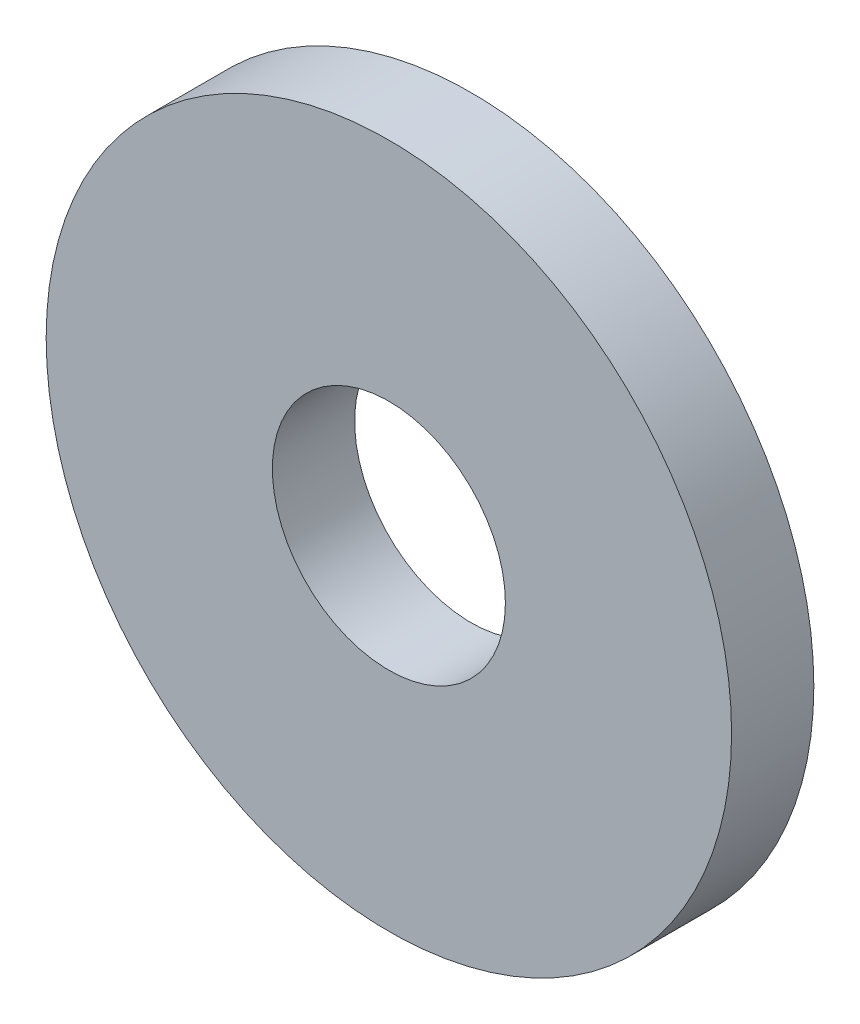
from build123d import *

# Parameters (mm, degrees)
ESQUISSE1_R      = 2.5
ESQUISSE1_R_2    = 0.85
EXTRUSION1_DEPTH = 0.6


with BuildPart() as part:
    # Esquisse1 → Extrusion1 (new body)
    with BuildSketch(Plane.XY):
        Circle(ESQUISSE1_R)
        Circle(ESQUISSE1_R_2, mode=Mode.SUBTRACT)
    extrude(amount=EXTRUSION1_DEPTH)


solid = part.part
